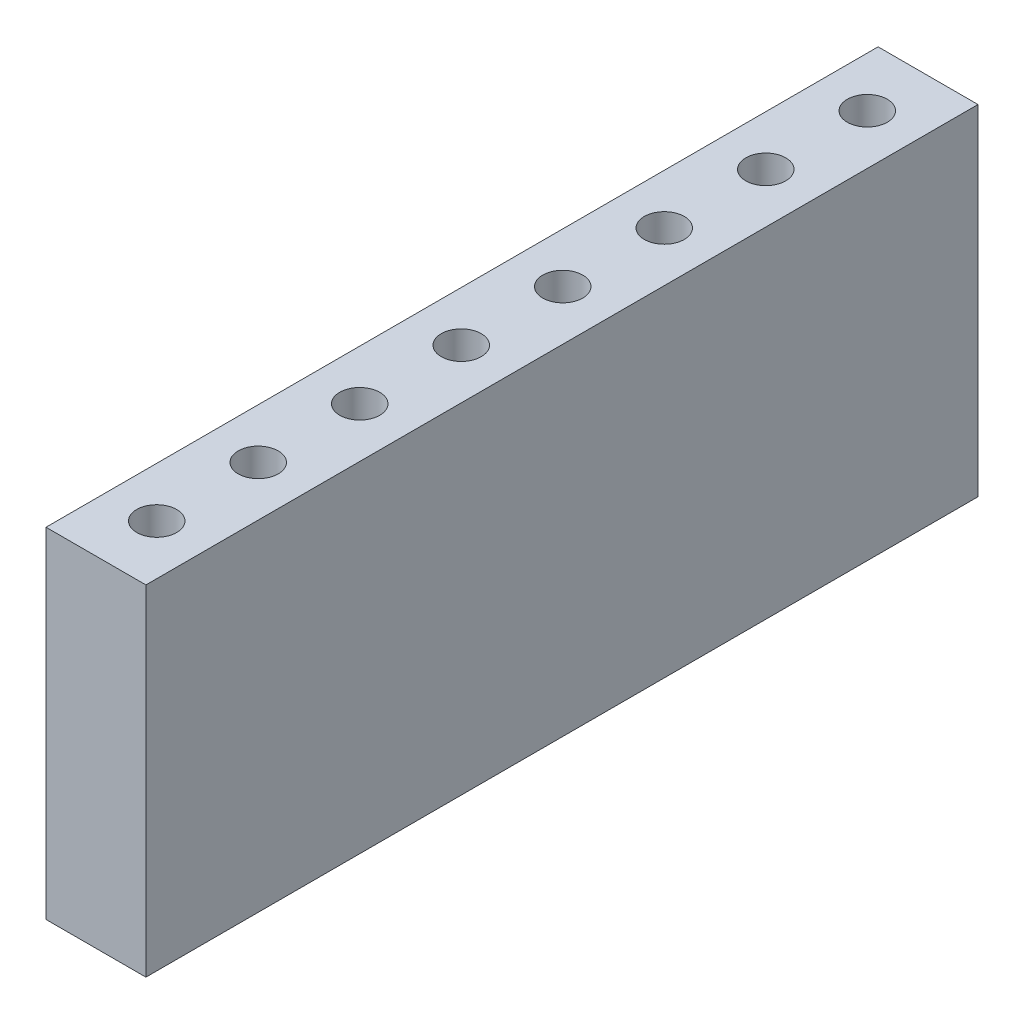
from build123d import *

# Parameters (mm, degrees)
SKETCH1_W          = 2.5
SKETCH1_H          = 20.820000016
EXTRUDE1_DEPTH     = 8.5
SKETCH2_R          = 0.5
CUT_EXTRUDE1_DEPTH = 6.38


with BuildPart() as part:
    # Sketch1 → Extrude1 (new body)
    with BuildSketch(Plane(origin=(0, 0, 0), x_dir=(1, 0, 0), z_dir=(0, 1, 0))):
        with Locations((1.25, 10.410000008)):
            Rectangle(SKETCH1_W, SKETCH1_H)
    extrude(amount=EXTRUDE1_DEPTH)

    # Sketch2 → Cut-Extrude1 (cut)
    with BuildSketch(Plane(origin=(0, 8.5, 0), x_dir=(-1, 0, 0), z_dir=(0, 1, 0))):
        with Locations(Location((-1.25, -9.140000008, 0), (0, 0, 90))):
            Circle(SKETCH2_R)
        with Locations(Location((-1.25, -6.600000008, 0), (0, 0, 90))):
            Circle(SKETCH2_R)
        with Locations(Location((-1.25, -4.060000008, 0), (0, 0, 90))):
            Circle(SKETCH2_R)
        with Locations(Location((-1.25, -1.520000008, 0), (0, 0, 90))):
            Circle(SKETCH2_R)
        with Locations(Location((-1.25, -19.300000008, 0), (0, 0, 270))):
            Circle(SKETCH2_R)
        with Locations(Location((-1.25, -16.760000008, 0), (0, 0, 270))):
            Circle(SKETCH2_R)
        with Locations(Location((-1.25, -14.220000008, 0), (0, 0, 270))):
            Circle(SKETCH2_R)
        with Locations(Location((-1.25, -11.680000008, 0), (0, 0, 270))):
            Circle(SKETCH2_R)
    extrude(amount=-CUT_EXTRUDE1_DEPTH, mode=Mode.SUBTRACT)


solid = part.part
